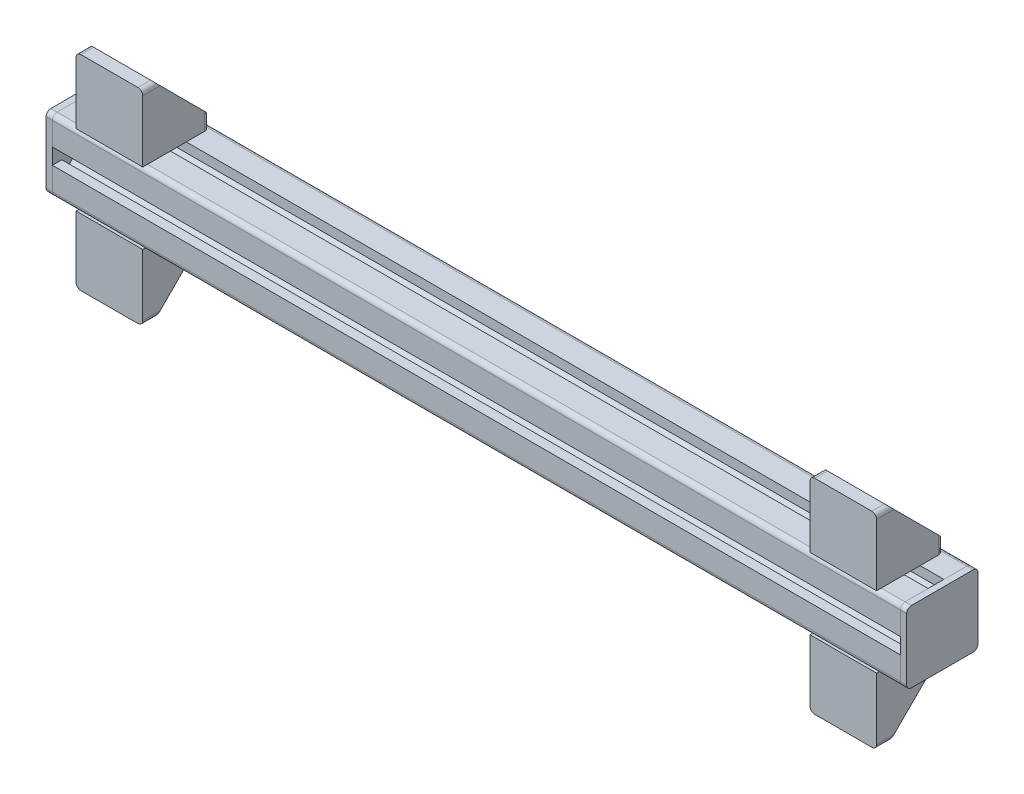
from build123d import *

# Parameters (mm, degrees)
BOSS_EXTRUDE1_DEPTH      = 267.5
BOSS_EXTRUDE1_DEPTH_BACK = 267.5
BOSS_EXTRUDE2_DEPTH      = 21
BOSS_EXTRUDE2_2_DEPTH    = 21
FILLET1_R                = 3
FILLET2_R                = 3
BOSS_EXTRUDE4_DEPTH      = 4


with BuildPart() as part:
    # Sketch1 → Boss-Extrude1 (new, two sides: drawn at the far end of the back side and taken through both)
    with BuildSketch(Plane(origin=(0, 0, 0), x_dir=(0, 0, -1), z_dir=(1, 0, 0)).offset(-BOSS_EXTRUDE1_DEPTH_BACK)):
        with BuildLine():
            Line((-19.5, 22.5), (-5, 22.5))
            Line((-5, 22.5), (-5, 16.5))
            Line((-5, 16.5), (-10, 16.5))
            Line((-10, 16.5), (-10, 12))
            Line((-10, 12), (-7.5, 9.5))
            Line((-7.5, 9.5), (7.5, 9.5))
            Line((7.5, 9.5), (10, 12))
            Line((10, 12), (10, 16.5))
            Line((10, 16.5), (5, 16.5))
            Line((5, 16.5), (5, 22.5))
            Line((5, 22.5), (19.5, 22.5))
            ThreePointArc((19.5, 22.5), (21.621320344, 21.621320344), (22.5, 19.5))
            Line((22.5, 19.5), (22.5, 5))
            Line((22.5, 5), (16.5, 5))
            Line((16.5, 5), (16.5, 10))
            Line((16.5, 10), (12, 10))
            Line((12, 10), (9.5, 7.5))
            Line((9.5, 7.5), (9.5, -7.5))
            Line((9.5, -7.5), (12, -10))
            Line((12, -10), (16.5, -10))
            Line((16.5, -10), (16.5, -5))
            Line((16.5, -5), (22.5, -5))
            Line((22.5, -5), (22.5, -19.5))
            ThreePointArc((22.5, -19.5), (21.621320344, -21.621320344), (19.5, -22.5))
            Line((19.5, -22.5), (5, -22.5))
            Line((5, -22.5), (5, -16.5))
            Line((5, -16.5), (10, -16.5))
            Line((10, -16.5), (10, -12))
            Line((10, -12), (7.5, -9.5))
            Line((7.5, -9.5), (-7.5, -9.5))
            Line((-7.5, -9.5), (-10, -12))
            Line((-10, -12), (-10, -16.5))
            Line((-10, -16.5), (-5, -16.5))
            Line((-5, -16.5), (-5, -22.5))
            Line((-5, -22.5), (-19.5, -22.5))
            ThreePointArc((-19.5, -22.5), (-21.621320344, -21.621320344), (-22.5, -19.5))
            Line((-22.5, -19.5), (-22.5, -5))
            Line((-22.5, -5), (-16.5, -5))
            Line((-16.5, -5), (-16.5, -10))
            Line((-16.5, -10), (-12, -10))
            Line((-12, -10), (-9.5, -7.5))
            Line((-9.5, -7.5), (-9.5, 7.5))
            Line((-9.5, 7.5), (-12, 10))
            Line((-12, 10), (-16.5, 10))
            Line((-16.5, 10), (-16.5, 5))
            Line((-16.5, 5), (-22.5, 5))
            Line((-22.5, 5), (-22.5, 19.5))
            ThreePointArc((-22.5, 19.5), (-21.621320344, 21.621320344), (-19.5, 22.5))
        make_face()
    extrude(amount=BOSS_EXTRUDE1_DEPTH + BOSS_EXTRUDE1_DEPTH_BACK)


with BuildPart() as body_2:
    # Sketch3 → Boss-Extrude2 (new, symmetric)
    with BuildSketch(Plane(origin=(231.5, 0, 0), x_dir=(0, 0, -1), z_dir=(1, 0, 0))):
        Polygon((19.5, 22.5), (-22.5, 22.5), (-22.5, 64.5), (-14.5, 64.5), (19.5, 30.5), align=None)
    extrude(amount=BOSS_EXTRUDE2_DEPTH, both=True)

    # Fillet1
    fillet1_edges = [body_2.edges().sort_by_distance(p)[0] for p in [
        (252.5, 64.5, 18.5),
        (252.5, 26.5, -19.5),
        (210.5, 64.5, 18.5),
        (210.5, 26.5, -19.5),
    ]]
    fillet(fillet1_edges, radius=FILLET1_R)


with BuildPart() as body_3:
    # Sketch3 → Boss-Extrude2 2 (new, symmetric)
    with BuildSketch(Plane(origin=(231.5, 0, 0), x_dir=(0, 0, -1), z_dir=(1, 0, 0))):
        Polygon((-22.5, -64.5), (-22.5, -22.5), (19.5, -22.5), (19.5, -30.5), (-14.5, -64.5), align=None)
    extrude(amount=BOSS_EXTRUDE2_2_DEPTH, both=True)

    # Fillet2
    fillet2_edges = [body_3.edges().sort_by_distance(p)[0] for p in [
        (252.5, -26.5, -19.5),
        (252.5, -64.5, 18.5),
        (210.5, -26.5, -19.5),
        (210.5, -64.5, 18.5),
    ]]
    fillet(fillet2_edges, radius=FILLET2_R)


with BuildPart() as body_4:
    # Sketch5 → Boss-Extrude4 (new body)
    with BuildSketch(Plane(origin=(267.5, 0, 0), x_dir=(0, 0, -1), z_dir=(1, 0, 0))):
        with BuildLine():
            Line((19.5, 22.5), (-19.5, 22.5))
            ThreePointArc((-19.5, 22.5), (-21.621320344, 21.621320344), (-22.5, 19.5))
            Line((-22.5, 19.5), (-22.5, -19.5))
            ThreePointArc((-22.5, -19.5), (-21.621320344, -21.621320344), (-19.5, -22.5))
            Line((-19.5, -22.5), (19.5, -22.5))
            ThreePointArc((19.5, -22.5), (21.621320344, -21.621320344), (22.5, -19.5))
            Line((22.5, -19.5), (22.5, 19.5))
            ThreePointArc((22.5, 19.5), (21.621320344, 21.621320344), (19.5, 22.5))
        make_face()
    extrude(amount=BOSS_EXTRUDE4_DEPTH)


with BuildPart() as body_5:
    # Mirror1: mirrored copy
    add(body_4.part.mirror(Plane(origin=(0, 0, 0), x_dir=(0, 0, 1), z_dir=(1, 0, 0))))


with BuildPart() as body_6:
    # Mirror1 2: mirrored copy
    add(body_2.part.mirror(Plane(origin=(0, 0, 0), x_dir=(0, 0, 1), z_dir=(1, 0, 0))))


with BuildPart() as body_7:
    # Mirror1 3: mirrored copy
    add(body_3.part.mirror(Plane(origin=(0, 0, 0), x_dir=(0, 0, 1), z_dir=(1, 0, 0))))


solid = Compound([part.part, body_2.part, body_3.part, body_4.part, body_5.part, body_6.part, body_7.part])
